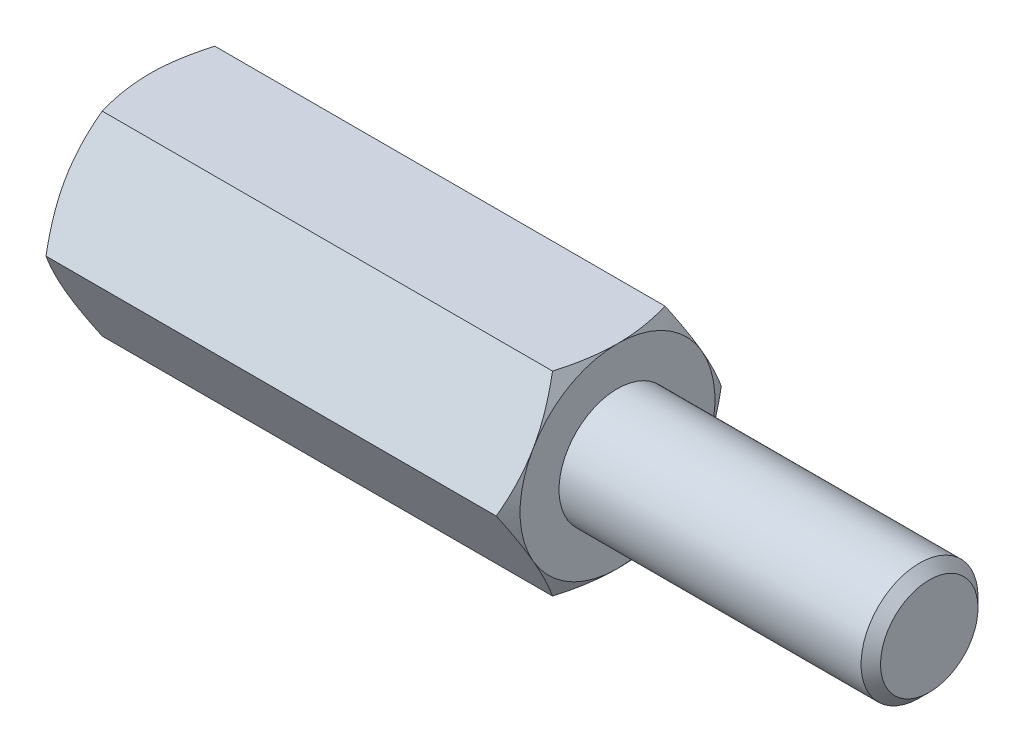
ISO-10303-21;
HEADER;
FILE_DESCRIPTION(('STEP AP214'),'2;1');
FILE_NAME('part.step','',(''),(''),'','','');
FILE_SCHEMA(('AUTOMOTIVE_DESIGN { 1 0 10303 214 1 1 1 1 }'));
ENDSEC;
DATA;
#1=APPLICATION_CONTEXT('core data for automotive mechanical design processes');
#2=APPLICATION_PROTOCOL_DEFINITION('international standard','automotive_design',2000,#1);
#3=PRODUCT_CONTEXT('',#1,'mechanical');
#4=PRODUCT('Part','Part','',(#3));
#5=PRODUCT_RELATED_PRODUCT_CATEGORY('part','',(#4));
#6=PRODUCT_DEFINITION_FORMATION('','',#4);
#7=PRODUCT_DEFINITION_CONTEXT('part definition',#1,'design');
#8=PRODUCT_DEFINITION('design','',#6,#7);
#9=PRODUCT_DEFINITION_SHAPE('','',#8);
#10=(LENGTH_UNIT() NAMED_UNIT(*) SI_UNIT(.MILLI.,.METRE.));
#11=(NAMED_UNIT(*) PLANE_ANGLE_UNIT() SI_UNIT($,.RADIAN.));
#12=(NAMED_UNIT(*) SI_UNIT($,.STERADIAN.) SOLID_ANGLE_UNIT());
#13=UNCERTAINTY_MEASURE_WITH_UNIT(LENGTH_MEASURE(1.E-05),#10,'distance_accuracy_value','');
#14=(GEOMETRIC_REPRESENTATION_CONTEXT(3) GLOBAL_UNCERTAINTY_ASSIGNED_CONTEXT((#13)) GLOBAL_UNIT_ASSIGNED_CONTEXT((#10,
#11,#12)) REPRESENTATION_CONTEXT('',''));
#15=CARTESIAN_POINT('',(0.,0.,0.));
#16=DIRECTION('',(0.,0.,1.));
#17=DIRECTION('',(1.,0.,0.));
#18=AXIS2_PLACEMENT_3D('',#15,#16,#17);
#19=CARTESIAN_POINT('',(6.,2.5,-1.44337567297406));
#20=DIRECTION('',(1.,0.,0.));
#21=DIRECTION('',(0.,0.,-1.));
#22=AXIS2_PLACEMENT_3D('',#19,#20,#21);
#23=PLANE('',#22);
#24=CARTESIAN_POINT('',(6.,0.,0.));
#25=DIRECTION('',(1.,0.,0.));
#26=DIRECTION('',(0.,0.,-1.));
#27=AXIS2_PLACEMENT_3D('',#24,#25,#26);
#28=CIRCLE('',#27,2.5);
#29=CARTESIAN_POINT('',(6.,-1.25,-2.1650635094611));
#30=VERTEX_POINT('',#29);
#31=CARTESIAN_POINT('',(6.,1.25,-2.1650635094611));
#32=VERTEX_POINT('',#31);
#33=EDGE_CURVE('E288',#30,#32,#28,.T.);
#34=ORIENTED_EDGE('',*,*,#33,.T.);
#35=CARTESIAN_POINT('',(6.,2.5,0.));
#36=VERTEX_POINT('',#35);
#37=EDGE_CURVE('E53',#32,#36,#28,.T.);
#38=ORIENTED_EDGE('',*,*,#37,.T.);
#39=CARTESIAN_POINT('',(6.,1.25,2.1650635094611));
#40=VERTEX_POINT('',#39);
#41=EDGE_CURVE('E295',#36,#40,#28,.T.);
#42=ORIENTED_EDGE('',*,*,#41,.T.);
#43=CARTESIAN_POINT('',(6.,-1.25,2.1650635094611));
#44=VERTEX_POINT('',#43);
#45=EDGE_CURVE('E300',#40,#44,#28,.T.);
#46=ORIENTED_EDGE('',*,*,#45,.T.);
#47=CARTESIAN_POINT('',(6.,0.,0.));
#48=DIRECTION('',(-1.,0.,0.));
#49=DIRECTION('',(0.,-1.,0.));
#50=AXIS2_PLACEMENT_3D('',#47,#48,#49);
#51=CIRCLE('',#50,2.5);
#52=CARTESIAN_POINT('',(6.,-2.5,0.));
#53=VERTEX_POINT('',#52);
#54=EDGE_CURVE('E193',#53,#44,#51,.T.);
#55=ORIENTED_EDGE('',*,*,#54,.F.);
#56=EDGE_CURVE('E61',#53,#30,#28,.T.);
#57=ORIENTED_EDGE('',*,*,#56,.T.);
#58=EDGE_LOOP('',(#34,#38,#42,#46,#55,#57));
#59=FACE_BOUND('',#58,.T.);
#60=CARTESIAN_POINT('',(6.,0.,0.));
#61=DIRECTION('',(1.,0.,0.));
#62=DIRECTION('',(0.,0.,-1.));
#63=AXIS2_PLACEMENT_3D('',#60,#61,#62);
#64=CIRCLE('',#63,1.5);
#65=CARTESIAN_POINT('',(6.,0.,-1.5));
#66=VERTEX_POINT('',#65);
#67=EDGE_CURVE('E318',#66,#66,#64,.T.);
#68=ORIENTED_EDGE('',*,*,#67,.F.);
#69=EDGE_LOOP('',(#68));
#70=FACE_BOUND('',#69,.T.);
#71=ADVANCED_FACE('F37',(#59,#70),#23,.T.);
#72=CARTESIAN_POINT('',(6.,0.,-2.88675134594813));
#73=DIRECTION('',(0.,-0.5,0.866025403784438));
#74=DIRECTION('',(0.,-0.866025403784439,-0.5));
#75=AXIS2_PLACEMENT_3D('',#72,#73,#74);
#76=PLANE('',#75);
#77=CARTESIAN_POINT('',(5.77664233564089,-0.000199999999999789,-2.88686681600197));
#78=CARTESIAN_POINT('',(5.81327837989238,0.109663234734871,-2.82343724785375));
#79=CARTESIAN_POINT('',(5.84659778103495,0.220474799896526,-2.75946016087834));
#80=CARTESIAN_POINT('',(5.90475771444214,0.444016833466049,-2.63039810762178));
#81=CARTESIAN_POINT('',(5.92957767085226,0.556751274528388,-2.5653108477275));
#82=CARTESIAN_POINT('',(5.96821434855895,0.780822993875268,-2.43594298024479));
#83=CARTESIAN_POINT('',(5.98228820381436,0.892125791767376,-2.37168227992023));
#84=CARTESIAN_POINT('',(5.99909084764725,1.11525522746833,-2.24285844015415));
#85=CARTESIAN_POINT('',(6.00183354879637,1.22708105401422,-2.17829576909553));
#86=CARTESIAN_POINT('',(5.99613423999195,1.43604197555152,-2.05765212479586));
#87=CARTESIAN_POINT('',(5.98909160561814,1.53320831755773,-2.0015531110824));
#88=CARTESIAN_POINT('',(5.96676858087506,1.726907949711,-1.88972057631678));
#89=CARTESIAN_POINT('',(5.95148056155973,1.82344056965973,-1.8339874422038));
#90=CARTESIAN_POINT('',(5.91326090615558,2.01753972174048,-1.7219242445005));
#91=CARTESIAN_POINT('',(5.89016722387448,2.11508168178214,-1.66560836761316));
#92=CARTESIAN_POINT('',(5.83775334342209,2.30871060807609,-1.55381665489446));
#93=CARTESIAN_POINT('',(5.80844546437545,2.40480005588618,-1.49833938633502));
#94=CARTESIAN_POINT('',(5.77664233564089,2.5002,-1.44326020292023));
#95=B_SPLINE_CURVE_WITH_KNOTS('',3,(#77,#78,#79,#80,#81,#82,#83,#84,#85,#86,#87,#88,#89,#90,#91,
#92,#93,#94),.UNSPECIFIED.,.F.,.F.,(4,2,2,2,2,2,2,2,4),(0.,0.396285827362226,0.793524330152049,
1.18093086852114,1.56786160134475,1.90479741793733,2.24204551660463,2.58677531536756,
2.93082800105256),.UNSPECIFIED.);
#96=CARTESIAN_POINT('',(5.7767090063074,0.,-2.88675134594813));
#97=VERTEX_POINT('',#96);
#98=EDGE_CURVE('E352',#97,#32,#95,.T.);
#99=ORIENTED_EDGE('',*,*,#98,.F.);
#100=DIRECTION('',(-1.,0.,0.));
#101=VECTOR('',#100,1.);
#102=CARTESIAN_POINT('',(6.,0.,-2.88675134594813));
#103=LINE('',#102,#101);
#104=CARTESIAN_POINT('',(-5.7767090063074,0.,-2.88675134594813));
#105=VERTEX_POINT('',#104);
#106=EDGE_CURVE('E264',#97,#105,#103,.T.);
#107=ORIENTED_EDGE('',*,*,#106,.T.);
#108=CARTESIAN_POINT('',(-5.77664233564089,2.5002,-1.44326020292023));
#109=CARTESIAN_POINT('',(-5.81327837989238,2.39033676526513,-1.50668977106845));
#110=CARTESIAN_POINT('',(-5.84659778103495,2.27952520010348,-1.57066685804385));
#111=CARTESIAN_POINT('',(-5.90475771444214,2.05598316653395,-1.69972891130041));
#112=CARTESIAN_POINT('',(-5.92957767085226,1.94324872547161,-1.7648161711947));
#113=CARTESIAN_POINT('',(-5.96821434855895,1.71917700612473,-1.8941840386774));
#114=CARTESIAN_POINT('',(-5.98228820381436,1.60787420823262,-1.95844473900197));
#115=CARTESIAN_POINT('',(-5.99909084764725,1.38474477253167,-2.08726857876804));
#116=CARTESIAN_POINT('',(-6.00183354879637,1.27291894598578,-2.15183124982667));
#117=CARTESIAN_POINT('',(-5.99613423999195,1.06395802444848,-2.27247489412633));
#118=CARTESIAN_POINT('',(-5.98909160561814,0.96679168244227,-2.32857390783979));
#119=CARTESIAN_POINT('',(-5.96676858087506,0.773092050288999,-2.44040644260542));
#120=CARTESIAN_POINT('',(-5.95148056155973,0.676559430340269,-2.49613957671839));
#121=CARTESIAN_POINT('',(-5.91326090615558,0.482460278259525,-2.60820277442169));
#122=CARTESIAN_POINT('',(-5.89016722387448,0.38491831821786,-2.66451865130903));
#123=CARTESIAN_POINT('',(-5.83775334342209,0.191289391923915,-2.77631036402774));
#124=CARTESIAN_POINT('',(-5.80844546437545,0.095199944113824,-2.83178763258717));
#125=CARTESIAN_POINT('',(-5.77664233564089,-0.000199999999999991,-2.88686681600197));
#126=B_SPLINE_CURVE_WITH_KNOTS('',3,(#108,#109,#110,#111,#112,#113,#114,#115,#116,#117,#118,
#119,#120,#121,#122,#123,#124,#125),.UNSPECIFIED.,.F.,.F.,(4,2,2,2,2,2,2,2,4),(0.,
0.396285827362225,0.793524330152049,1.18093086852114,1.56786160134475,1.90479741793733,
2.24204551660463,2.58677531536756,2.93082800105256),.UNSPECIFIED.);
#127=CARTESIAN_POINT('',(-6.,1.25,-2.1650635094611));
#128=VERTEX_POINT('',#127);
#129=EDGE_CURVE('E368',#128,#105,#126,.T.);
#130=ORIENTED_EDGE('',*,*,#129,.F.);
#131=CARTESIAN_POINT('',(-5.7767090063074,2.5,-1.44337567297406));
#132=VERTEX_POINT('',#131);
#133=EDGE_CURVE('E311',#132,#128,#126,.T.);
#134=ORIENTED_EDGE('',*,*,#133,.F.);
#135=DIRECTION('',(-1.,0.,0.));
#136=VECTOR('',#135,1.);
#137=CARTESIAN_POINT('',(6.,2.5,-1.44337567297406));
#138=LINE('',#137,#136);
#139=CARTESIAN_POINT('',(5.77670900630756,2.5,-1.44337567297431));
#140=VERTEX_POINT('',#139);
#141=EDGE_CURVE('E279',#140,#132,#138,.T.);
#142=ORIENTED_EDGE('',*,*,#141,.F.);
#143=EDGE_CURVE('E229',#32,#140,#95,.T.);
#144=ORIENTED_EDGE('',*,*,#143,.F.);
#145=EDGE_LOOP('',(#99,#107,#130,#134,#142,#144));
#146=FACE_BOUND('',#145,.T.);
#147=ADVANCED_FACE('F148',(#146),#76,.F.);
#148=CARTESIAN_POINT('',(6.,2.5,-1.44337567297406));
#149=DIRECTION('',(0.,-1.,0.));
#150=DIRECTION('',(0.,0.,-1.));
#151=AXIS2_PLACEMENT_3D('',#148,#149,#150);
#152=PLANE('',#151);
#153=CARTESIAN_POINT('',(4.76803388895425,2.5,-3.90158441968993));
#154=CARTESIAN_POINT('',(4.82120772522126,2.5,-3.79217004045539));
#155=CARTESIAN_POINT('',(4.87387869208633,2.5,-3.68250707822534));
#156=CARTESIAN_POINT('',(4.97793249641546,2.5,-3.46255185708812));
#157=CARTESIAN_POINT('',(5.02931513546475,2.5,-3.35225950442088));
#158=CARTESIAN_POINT('',(5.13076309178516,2.5,-3.130356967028));
#159=CARTESIAN_POINT('',(5.18081992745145,2.5,-3.01874289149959));
#160=CARTESIAN_POINT('',(5.27891712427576,2.5,-2.79463535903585));
#161=CARTESIAN_POINT('',(5.32695757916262,2.5,-2.68214194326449));
#162=CARTESIAN_POINT('',(5.42201845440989,2.5,-2.45240385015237));
#163=CARTESIAN_POINT('',(5.46895431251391,2.5,-2.33512399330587));
#164=CARTESIAN_POINT('',(5.55933269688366,2.5,-2.09920133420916));
#165=CARTESIAN_POINT('',(5.60277483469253,2.5,-1.98055838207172));
#166=CARTESIAN_POINT('',(5.68504351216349,2.5,-1.74193489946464));
#167=CARTESIAN_POINT('',(5.72387917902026,2.5,-1.6219575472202));
#168=CARTESIAN_POINT('',(5.79570507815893,2.5,-1.38028205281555));
#169=CARTESIAN_POINT('',(5.82869712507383,2.5,-1.25858445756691));
#170=CARTESIAN_POINT('',(5.88709594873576,2.5,-1.01406369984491));
#171=CARTESIAN_POINT('',(5.91254379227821,2.5,-0.891250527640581));
#172=CARTESIAN_POINT('',(5.95442751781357,2.5,-0.644071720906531));
#173=CARTESIAN_POINT('',(5.97086432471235,2.5,-0.519706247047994));
#174=CARTESIAN_POINT('',(5.9932006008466,2.5,-0.271679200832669));
#175=CARTESIAN_POINT('',(5.99923751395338,2.5,-0.148030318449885));
#176=CARTESIAN_POINT('',(6.00062561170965,2.5,0.0993395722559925));
#177=CARTESIAN_POINT('',(5.99597656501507,2.5,0.223060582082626));
#178=CARTESIAN_POINT('',(5.97940443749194,2.5,0.432351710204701));
#179=CARTESIAN_POINT('',(5.97010665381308,2.5,0.518143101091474));
#180=CARTESIAN_POINT('',(5.94693847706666,2.5,0.689112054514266));
#181=CARTESIAN_POINT('',(5.93306748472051,2.5,0.774289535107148));
#182=CARTESIAN_POINT('',(5.88532020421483,2.5,1.02876599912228));
#183=CARTESIAN_POINT('',(5.84531764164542,2.5,1.19691958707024));
#184=CARTESIAN_POINT('',(5.75226567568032,2.5,1.53362893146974));
#185=CARTESIAN_POINT('',(5.69893620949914,2.5,1.70210423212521));
#186=CARTESIAN_POINT('',(5.61237169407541,2.5,1.95247339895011));
#187=CARTESIAN_POINT('',(5.58242477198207,2.5,2.03553184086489));
#188=CARTESIAN_POINT('',(5.52068409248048,2.5,2.20095860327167));
#189=CARTESIAN_POINT('',(5.48889037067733,2.5,2.2833269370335));
#190=CARTESIAN_POINT('',(5.40401426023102,2.5,2.49723312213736));
#191=CARTESIAN_POINT('',(5.34971733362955,2.5,2.6282879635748));
#192=CARTESIAN_POINT('',(5.2381273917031,2.5,2.88912034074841));
#193=CARTESIAN_POINT('',(5.1808341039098,2.5,3.01889775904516));
#194=CARTESIAN_POINT('',(5.06393487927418,2.5,3.27745045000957));
#195=CARTESIAN_POINT('',(5.00432825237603,2.5,3.40622540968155));
#196=CARTESIAN_POINT('',(4.8833234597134,2.5,3.66293235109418));
#197=CARTESIAN_POINT('',(4.82192524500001,2.5,3.79086430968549));
#198=CARTESIAN_POINT('',(4.6354580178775,2.5,4.17399495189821));
#199=CARTESIAN_POINT('',(4.50828249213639,2.5,4.42816724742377));
#200=CARTESIAN_POINT('',(4.25034557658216,2.5,4.93461464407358));
#201=CARTESIAN_POINT('',(4.11958483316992,2.5,5.18689007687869));
#202=CARTESIAN_POINT('',(3.86871001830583,2.5,5.66512451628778));
#203=CARTESIAN_POINT('',(3.74882986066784,2.5,5.89120644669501));
#204=CARTESIAN_POINT('',(3.50759021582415,2.5,6.34259369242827));
#205=CARTESIAN_POINT('',(3.38623065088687,2.5,6.56789896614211));
#206=CARTESIAN_POINT('',(3.14278038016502,2.5,7.01722044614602));
#207=CARTESIAN_POINT('',(3.02069305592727,2.5,7.24123848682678));
#208=CARTESIAN_POINT('',(2.77566624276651,2.5,7.68878772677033));
#209=CARTESIAN_POINT('',(2.65272681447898,2.5,7.9123189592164));
#210=CARTESIAN_POINT('',(2.52947566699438,2.5,8.13567697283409));
#211=B_SPLINE_CURVE_WITH_KNOTS('',3,(#153,#154,#155,#156,#157,#158,#159,#160,#161,#162,#163,
#164,#165,#166,#167,#168,#169,#170,#171,#172,#173,#174,#175,#176,#177,#178,#179,#180,#181,#182,
#183,#184,#185,#186,#187,#188,#189,#190,#191,#192,#193,#194,#195,#196,#197,#198,#199,#200,#201,
#202,#203,#204,#205,#206,#207,#208,#209,#210),.UNSPECIFIED.,.F.,.F.,(4,2,2,2,2,2,2,2,2,2,2,2,2,
2,2,2,2,2,2,2,2,2,2,2,2,2,2,2,4),(0.,0.364957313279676,0.729970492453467,1.09692930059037,
1.46387103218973,1.84279746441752,2.22176597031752,2.59997058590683,2.97805755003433,
3.35404692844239,3.72999770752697,4.10094071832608,4.47189175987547,4.73064905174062,
4.98944026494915,5.5072907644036,6.03710483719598,6.30196454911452,6.56681915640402,
6.99233818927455,7.41789598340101,7.84358170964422,8.26927907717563,9.12186602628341,
9.97430025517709,10.7419897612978,11.5097197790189,12.2750964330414,13.0404191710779),.UNSPECIFIED.);
#212=EDGE_CURVE('E227',#140,#36,#211,.T.);
#213=ORIENTED_EDGE('',*,*,#212,.F.);
#214=ORIENTED_EDGE('',*,*,#141,.T.);
#215=CARTESIAN_POINT('',(-4.76803388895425,2.5,-3.90158441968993));
#216=CARTESIAN_POINT('',(-4.82120772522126,2.5,-3.79217004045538));
#217=CARTESIAN_POINT('',(-4.87387869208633,2.5,-3.68250707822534));
#218=CARTESIAN_POINT('',(-4.97793249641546,2.5,-3.46255185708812));
#219=CARTESIAN_POINT('',(-5.02931513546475,2.5,-3.35225950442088));
#220=CARTESIAN_POINT('',(-5.13076309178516,2.5,-3.130356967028));
#221=CARTESIAN_POINT('',(-5.18081992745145,2.5,-3.01874289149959));
#222=CARTESIAN_POINT('',(-5.27891712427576,2.5,-2.79463535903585));
#223=CARTESIAN_POINT('',(-5.32695757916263,2.5,-2.68214194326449));
#224=CARTESIAN_POINT('',(-5.42201845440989,2.5,-2.45240385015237));
#225=CARTESIAN_POINT('',(-5.46895431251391,2.5,-2.33512399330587));
#226=CARTESIAN_POINT('',(-5.55933269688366,2.5,-2.09920133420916));
#227=CARTESIAN_POINT('',(-5.60277483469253,2.5,-1.98055838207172));
#228=CARTESIAN_POINT('',(-5.68504351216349,2.5,-1.74193489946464));
#229=CARTESIAN_POINT('',(-5.72387917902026,2.5,-1.6219575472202));
#230=CARTESIAN_POINT('',(-5.79570507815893,2.5,-1.38028205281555));
#231=CARTESIAN_POINT('',(-5.82869712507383,2.5,-1.25858445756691));
#232=CARTESIAN_POINT('',(-5.88709594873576,2.5,-1.01406369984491));
#233=CARTESIAN_POINT('',(-5.91254379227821,2.5,-0.891250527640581));
#234=CARTESIAN_POINT('',(-5.95442751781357,2.5,-0.64407172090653));
#235=CARTESIAN_POINT('',(-5.97086432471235,2.5,-0.519706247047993));
#236=CARTESIAN_POINT('',(-5.9932006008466,2.5,-0.271679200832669));
#237=CARTESIAN_POINT('',(-5.99923751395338,2.5,-0.148030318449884));
#238=CARTESIAN_POINT('',(-6.00062561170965,2.5,0.0993395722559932));
#239=CARTESIAN_POINT('',(-5.99597656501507,2.5,0.223060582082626));
#240=CARTESIAN_POINT('',(-5.97940443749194,2.5,0.432351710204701));
#241=CARTESIAN_POINT('',(-5.97010665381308,2.5,0.518143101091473));
#242=CARTESIAN_POINT('',(-5.94693847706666,2.5,0.689112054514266));
#243=CARTESIAN_POINT('',(-5.93306748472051,2.5,0.774289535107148));
#244=CARTESIAN_POINT('',(-5.88532020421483,2.5,1.02876599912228));
#245=CARTESIAN_POINT('',(-5.84531764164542,2.5,1.19691958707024));
#246=CARTESIAN_POINT('',(-5.75226567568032,2.5,1.53362893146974));
#247=CARTESIAN_POINT('',(-5.69893620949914,2.5,1.70210423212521));
#248=CARTESIAN_POINT('',(-5.61237169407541,2.5,1.95247339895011));
#249=CARTESIAN_POINT('',(-5.58242477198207,2.5,2.03553184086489));
#250=CARTESIAN_POINT('',(-5.52068409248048,2.5,2.20095860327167));
#251=CARTESIAN_POINT('',(-5.48889037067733,2.5,2.2833269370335));
#252=CARTESIAN_POINT('',(-5.40401426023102,2.5,2.49723312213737));
#253=CARTESIAN_POINT('',(-5.34971733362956,2.5,2.6282879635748));
#254=CARTESIAN_POINT('',(-5.2381273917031,2.5,2.88912034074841));
#255=CARTESIAN_POINT('',(-5.1808341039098,2.5,3.01889775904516));
#256=CARTESIAN_POINT('',(-5.06393487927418,2.5,3.27745045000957));
#257=CARTESIAN_POINT('',(-5.00432825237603,2.5,3.40622540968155));
#258=CARTESIAN_POINT('',(-4.88332345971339,2.5,3.66293235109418));
#259=CARTESIAN_POINT('',(-4.82192524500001,2.5,3.79086430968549));
#260=CARTESIAN_POINT('',(-4.6354580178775,2.5,4.17399495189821));
#261=CARTESIAN_POINT('',(-4.50828249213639,2.5,4.42816724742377));
#262=CARTESIAN_POINT('',(-4.25034557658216,2.5,4.93461464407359));
#263=CARTESIAN_POINT('',(-4.11958483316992,2.5,5.18689007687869));
#264=CARTESIAN_POINT('',(-3.86871001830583,2.5,5.66512451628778));
#265=CARTESIAN_POINT('',(-3.74882986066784,2.5,5.89120644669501));
#266=CARTESIAN_POINT('',(-3.50759021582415,2.5,6.34259369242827));
#267=CARTESIAN_POINT('',(-3.38623065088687,2.5,6.56789896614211));
#268=CARTESIAN_POINT('',(-3.14278038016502,2.5,7.01722044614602));
#269=CARTESIAN_POINT('',(-3.02069305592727,2.5,7.24123848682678));
#270=CARTESIAN_POINT('',(-2.77566624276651,2.5,7.68878772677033));
#271=CARTESIAN_POINT('',(-2.65272681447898,2.5,7.9123189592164));
#272=CARTESIAN_POINT('',(-2.52947566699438,2.5,8.13567697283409));
#273=B_SPLINE_CURVE_WITH_KNOTS('',3,(#215,#216,#217,#218,#219,#220,#221,#222,#223,#224,#225,
#226,#227,#228,#229,#230,#231,#232,#233,#234,#235,#236,#237,#238,#239,#240,#241,#242,#243,#244,
#245,#246,#247,#248,#249,#250,#251,#252,#253,#254,#255,#256,#257,#258,#259,#260,#261,#262,#263,
#264,#265,#266,#267,#268,#269,#270,#271,#272),.UNSPECIFIED.,.F.,.F.,(4,2,2,2,2,2,2,2,2,2,2,2,2,
2,2,2,2,2,2,2,2,2,2,2,2,2,2,2,4),(0.,0.364957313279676,0.729970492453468,1.09692930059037,
1.46387103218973,1.84279746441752,2.22176597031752,2.59997058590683,2.97805755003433,
3.35404692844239,3.72999770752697,4.10094071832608,4.47189175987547,4.73064905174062,
4.98944026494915,5.5072907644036,6.03710483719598,6.30196454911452,6.56681915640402,
6.99233818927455,7.41789598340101,7.84358170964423,8.26927907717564,9.12186602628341,
9.9743002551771,10.7419897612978,11.5097197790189,12.2750964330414,13.0404191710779),.UNSPECIFIED.);
#274=CARTESIAN_POINT('',(-6.,2.5,0.));
#275=VERTEX_POINT('',#274);
#276=EDGE_CURVE('E241',#275,#132,#273,.F.);
#277=ORIENTED_EDGE('',*,*,#276,.F.);
#278=CARTESIAN_POINT('',(-5.7767090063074,2.5,1.44337567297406));
#279=VERTEX_POINT('',#278);
#280=EDGE_CURVE('E249',#279,#275,#273,.F.);
#281=ORIENTED_EDGE('',*,*,#280,.F.);
#282=DIRECTION('',(-1.,0.,0.));
#283=VECTOR('',#282,1.);
#284=CARTESIAN_POINT('',(6.,2.5,1.44337567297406));
#285=LINE('',#284,#283);
#286=CARTESIAN_POINT('',(5.7767090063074,2.5,1.44337567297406));
#287=VERTEX_POINT('',#286);
#288=EDGE_CURVE('E276',#287,#279,#285,.T.);
#289=ORIENTED_EDGE('',*,*,#288,.F.);
#290=EDGE_CURVE('E221',#36,#287,#211,.T.);
#291=ORIENTED_EDGE('',*,*,#290,.F.);
#292=EDGE_LOOP('',(#213,#214,#277,#281,#289,#291));
#293=FACE_BOUND('',#292,.T.);
#294=ADVANCED_FACE('F153',(#293),#152,.F.);
#295=CARTESIAN_POINT('',(6.,2.5,1.44337567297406));
#296=DIRECTION('',(0.,-0.5,-0.866025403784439));
#297=DIRECTION('',(0.,0.866025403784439,-0.5));
#298=AXIS2_PLACEMENT_3D('',#295,#296,#297);
#299=PLANE('',#298);
#300=CARTESIAN_POINT('',(5.77664233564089,2.5002,1.44326020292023));
#301=CARTESIAN_POINT('',(5.81327837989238,2.39033676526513,1.50668977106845));
#302=CARTESIAN_POINT('',(5.84659778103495,2.27952520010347,1.57066685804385));
#303=CARTESIAN_POINT('',(5.90475771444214,2.05598316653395,1.69972891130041));
#304=CARTESIAN_POINT('',(5.92957767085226,1.94324872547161,1.7648161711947));
#305=CARTESIAN_POINT('',(5.96821434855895,1.71917700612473,1.8941840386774));
#306=CARTESIAN_POINT('',(5.98228820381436,1.60787420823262,1.95844473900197));
#307=CARTESIAN_POINT('',(5.99909084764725,1.38474477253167,2.08726857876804));
#308=CARTESIAN_POINT('',(6.00183354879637,1.27291894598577,2.15183124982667));
#309=CARTESIAN_POINT('',(5.99613423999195,1.06395802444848,2.27247489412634));
#310=CARTESIAN_POINT('',(5.98909160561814,0.966791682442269,2.32857390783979));
#311=CARTESIAN_POINT('',(5.96676858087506,0.773092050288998,2.44040644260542));
#312=CARTESIAN_POINT('',(5.95148056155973,0.676559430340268,2.49613957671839));
#313=CARTESIAN_POINT('',(5.91326090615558,0.482460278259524,2.60820277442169));
#314=CARTESIAN_POINT('',(5.89016722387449,0.384918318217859,2.66451865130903));
#315=CARTESIAN_POINT('',(5.83775334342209,0.191289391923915,2.77631036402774));
#316=CARTESIAN_POINT('',(5.80844546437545,0.0951999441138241,2.83178763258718));
#317=CARTESIAN_POINT('',(5.77664233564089,-0.000199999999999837,2.88686681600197));
#318=B_SPLINE_CURVE_WITH_KNOTS('',3,(#300,#301,#302,#303,#304,#305,#306,#307,#308,#309,#310,
#311,#312,#313,#314,#315,#316,#317),.UNSPECIFIED.,.F.,.F.,(4,2,2,2,2,2,2,2,4),(0.,
0.396285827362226,0.79352433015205,1.18093086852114,1.56786160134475,1.90479741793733,
2.24204551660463,2.58677531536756,2.93082800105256),.UNSPECIFIED.);
#319=EDGE_CURVE('E228',#287,#40,#318,.T.);
#320=ORIENTED_EDGE('',*,*,#319,.F.);
#321=ORIENTED_EDGE('',*,*,#288,.T.);
#322=CARTESIAN_POINT('',(-5.77664233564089,-0.000199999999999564,2.88686681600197));
#323=CARTESIAN_POINT('',(-5.81327837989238,0.109663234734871,2.82343724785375));
#324=CARTESIAN_POINT('',(-5.84659778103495,0.220474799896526,2.75946016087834));
#325=CARTESIAN_POINT('',(-5.90475771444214,0.44401683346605,2.63039810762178));
#326=CARTESIAN_POINT('',(-5.92957767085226,0.556751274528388,2.5653108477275));
#327=CARTESIAN_POINT('',(-5.96821434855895,0.780822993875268,2.43594298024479));
#328=CARTESIAN_POINT('',(-5.98228820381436,0.892125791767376,2.37168227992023));
#329=CARTESIAN_POINT('',(-5.99909084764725,1.11525522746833,2.24285844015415));
#330=CARTESIAN_POINT('',(-6.00183354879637,1.22708105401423,2.17829576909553));
#331=CARTESIAN_POINT('',(-5.99613423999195,1.43604197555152,2.05765212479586));
#332=CARTESIAN_POINT('',(-5.98909160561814,1.53320831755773,2.0015531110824));
#333=CARTESIAN_POINT('',(-5.96676858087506,1.726907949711,1.88972057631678));
#334=CARTESIAN_POINT('',(-5.95148056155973,1.82344056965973,1.8339874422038));
#335=CARTESIAN_POINT('',(-5.91326090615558,2.01753972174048,1.7219242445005));
#336=CARTESIAN_POINT('',(-5.89016722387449,2.11508168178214,1.66560836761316));
#337=CARTESIAN_POINT('',(-5.83775334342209,2.30871060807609,1.55381665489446));
#338=CARTESIAN_POINT('',(-5.80844546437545,2.40480005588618,1.49833938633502));
#339=CARTESIAN_POINT('',(-5.77664233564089,2.5002,1.44326020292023));
#340=B_SPLINE_CURVE_WITH_KNOTS('',3,(#322,#323,#324,#325,#326,#327,#328,#329,#330,#331,#332,
#333,#334,#335,#336,#337,#338,#339),.UNSPECIFIED.,.F.,.F.,(4,2,2,2,2,2,2,2,4),(0.,
0.396285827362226,0.79352433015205,1.18093086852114,1.56786160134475,1.90479741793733,
2.24204551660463,2.58677531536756,2.93082800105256),.UNSPECIFIED.);
#341=CARTESIAN_POINT('',(-6.,1.25,2.1650635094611));
#342=VERTEX_POINT('',#341);
#343=EDGE_CURVE('E255',#342,#279,#340,.T.);
#344=ORIENTED_EDGE('',*,*,#343,.F.);
#345=CARTESIAN_POINT('',(-5.7767090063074,0.,2.88675134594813));
#346=VERTEX_POINT('',#345);
#347=EDGE_CURVE('E262',#346,#342,#340,.T.);
#348=ORIENTED_EDGE('',*,*,#347,.F.);
#349=DIRECTION('',(-1.,0.,0.));
#350=VECTOR('',#349,1.);
#351=CARTESIAN_POINT('',(6.,0.,2.88675134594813));
#352=LINE('',#351,#350);
#353=CARTESIAN_POINT('',(5.7767090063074,0.,2.88675134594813));
#354=VERTEX_POINT('',#353);
#355=EDGE_CURVE('E273',#354,#346,#352,.T.);
#356=ORIENTED_EDGE('',*,*,#355,.F.);
#357=EDGE_CURVE('E215',#40,#354,#318,.T.);
#358=ORIENTED_EDGE('',*,*,#357,.F.);
#359=EDGE_LOOP('',(#320,#321,#344,#348,#356,#358));
#360=FACE_BOUND('',#359,.T.);
#361=ADVANCED_FACE('F235',(#360),#299,.F.);
#362=CARTESIAN_POINT('',(6.,0.,2.88675134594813));
#363=DIRECTION('',(0.,0.5,-0.866025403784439));
#364=DIRECTION('',(0.,0.866025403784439,0.5));
#365=AXIS2_PLACEMENT_3D('',#362,#363,#364);
#366=PLANE('',#365);
#367=CARTESIAN_POINT('',(5.77664233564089,0.000200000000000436,2.88686681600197));
#368=CARTESIAN_POINT('',(5.81327837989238,-0.109663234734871,2.82343724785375));
#369=CARTESIAN_POINT('',(5.84659778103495,-0.220474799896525,2.75946016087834));
#370=CARTESIAN_POINT('',(5.90475771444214,-0.444016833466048,2.63039810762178));
#371=CARTESIAN_POINT('',(5.92957767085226,-0.556751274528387,2.5653108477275));
#372=CARTESIAN_POINT('',(5.96821434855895,-0.780822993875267,2.43594298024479));
#373=CARTESIAN_POINT('',(5.98228820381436,-0.892125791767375,2.37168227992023));
#374=CARTESIAN_POINT('',(5.99909084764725,-1.11525522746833,2.24285844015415));
#375=CARTESIAN_POINT('',(6.00183354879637,-1.22708105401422,2.17829576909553));
#376=CARTESIAN_POINT('',(5.99613423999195,-1.43604197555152,2.05765212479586));
#377=CARTESIAN_POINT('',(5.98909160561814,-1.53320831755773,2.0015531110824));
#378=CARTESIAN_POINT('',(5.96676858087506,-1.726907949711,1.88972057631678));
#379=CARTESIAN_POINT('',(5.95148056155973,-1.82344056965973,1.8339874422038));
#380=CARTESIAN_POINT('',(5.91326090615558,-2.01753972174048,1.7219242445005));
#381=CARTESIAN_POINT('',(5.89016722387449,-2.11508168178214,1.66560836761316));
#382=CARTESIAN_POINT('',(5.83775334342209,-2.30871060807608,1.55381665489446));
#383=CARTESIAN_POINT('',(5.80844546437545,-2.40480005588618,1.49833938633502));
#384=CARTESIAN_POINT('',(5.77664233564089,-2.5002,1.44326020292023));
#385=B_SPLINE_CURVE_WITH_KNOTS('',3,(#367,#368,#369,#370,#371,#372,#373,#374,#375,#376,#377,
#378,#379,#380,#381,#382,#383,#384),.UNSPECIFIED.,.F.,.F.,(4,2,2,2,2,2,2,2,4),(0.,
0.396285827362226,0.793524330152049,1.18093086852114,1.56786160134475,1.90479741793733,
2.24204551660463,2.58677531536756,2.93082800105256),.UNSPECIFIED.);
#386=EDGE_CURVE('E315',#354,#44,#385,.T.);
#387=ORIENTED_EDGE('',*,*,#386,.F.);
#388=ORIENTED_EDGE('',*,*,#355,.T.);
#389=CARTESIAN_POINT('',(-5.77664233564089,-2.5002,1.44326020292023));
#390=CARTESIAN_POINT('',(-5.81327837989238,-2.39033676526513,1.50668977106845));
#391=CARTESIAN_POINT('',(-5.84659778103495,-2.27952520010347,1.57066685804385));
#392=CARTESIAN_POINT('',(-5.90475771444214,-2.05598316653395,1.69972891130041));
#393=CARTESIAN_POINT('',(-5.92957767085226,-1.94324872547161,1.7648161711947));
#394=CARTESIAN_POINT('',(-5.96821434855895,-1.71917700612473,1.8941840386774));
#395=CARTESIAN_POINT('',(-5.98228820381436,-1.60787420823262,1.95844473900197));
#396=CARTESIAN_POINT('',(-5.99909084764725,-1.38474477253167,2.08726857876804));
#397=CARTESIAN_POINT('',(-6.00183354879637,-1.27291894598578,2.15183124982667));
#398=CARTESIAN_POINT('',(-5.99613423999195,-1.06395802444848,2.27247489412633));
#399=CARTESIAN_POINT('',(-5.98909160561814,-0.96679168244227,2.32857390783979));
#400=CARTESIAN_POINT('',(-5.96676858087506,-0.773092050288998,2.44040644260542));
#401=CARTESIAN_POINT('',(-5.95148056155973,-0.676559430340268,2.49613957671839));
#402=CARTESIAN_POINT('',(-5.91326090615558,-0.482460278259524,2.60820277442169));
#403=CARTESIAN_POINT('',(-5.89016722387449,-0.384918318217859,2.66451865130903));
#404=CARTESIAN_POINT('',(-5.83775334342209,-0.191289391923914,2.77631036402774));
#405=CARTESIAN_POINT('',(-5.80844546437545,-0.0951999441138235,2.83178763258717));
#406=CARTESIAN_POINT('',(-5.77664233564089,0.000200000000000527,2.88686681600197));
#407=B_SPLINE_CURVE_WITH_KNOTS('',3,(#389,#390,#391,#392,#393,#394,#395,#396,#397,#398,#399,
#400,#401,#402,#403,#404,#405,#406),.UNSPECIFIED.,.F.,.F.,(4,2,2,2,2,2,2,2,4),(0.,
0.396285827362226,0.793524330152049,1.18093086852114,1.56786160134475,1.90479741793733,
2.24204551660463,2.58677531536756,2.93082800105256),.UNSPECIFIED.);
#408=CARTESIAN_POINT('',(-6.,-1.25,2.1650635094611));
#409=VERTEX_POINT('',#408);
#410=EDGE_CURVE('E263',#409,#346,#407,.T.);
#411=ORIENTED_EDGE('',*,*,#410,.F.);
#412=CARTESIAN_POINT('',(-5.7767090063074,-2.5,1.44337567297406));
#413=VERTEX_POINT('',#412);
#414=EDGE_CURVE('E250',#413,#409,#407,.T.);
#415=ORIENTED_EDGE('',*,*,#414,.F.);
#416=DIRECTION('',(-1.,0.,0.));
#417=VECTOR('',#416,1.);
#418=CARTESIAN_POINT('',(6.,-2.5,1.44337567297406));
#419=LINE('',#418,#417);
#420=CARTESIAN_POINT('',(5.7767090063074,-2.5,1.44337567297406));
#421=VERTEX_POINT('',#420);
#422=EDGE_CURVE('E270',#421,#413,#419,.T.);
#423=ORIENTED_EDGE('',*,*,#422,.F.);
#424=EDGE_CURVE('E210',#44,#421,#385,.T.);
#425=ORIENTED_EDGE('',*,*,#424,.F.);
#426=EDGE_LOOP('',(#387,#388,#411,#415,#423,#425));
#427=FACE_BOUND('',#426,.T.);
#428=ADVANCED_FACE('F402',(#427),#366,.F.);
#429=CARTESIAN_POINT('',(6.,-2.5,1.44337567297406));
#430=DIRECTION('',(0.,1.,0.));
#431=DIRECTION('',(0.,0.,1.));
#432=AXIS2_PLACEMENT_3D('',#429,#430,#431);
#433=PLANE('',#432);
#434=CARTESIAN_POINT('',(4.76803388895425,-2.5,-3.90158441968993));
#435=CARTESIAN_POINT('',(4.82120772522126,-2.5,-3.79217004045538));
#436=CARTESIAN_POINT('',(4.87387869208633,-2.5,-3.68250707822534));
#437=CARTESIAN_POINT('',(4.97793249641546,-2.5,-3.46255185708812));
#438=CARTESIAN_POINT('',(5.02931513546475,-2.5,-3.35225950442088));
#439=CARTESIAN_POINT('',(5.13076309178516,-2.5,-3.130356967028));
#440=CARTESIAN_POINT('',(5.18081992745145,-2.5,-3.01874289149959));
#441=CARTESIAN_POINT('',(5.27891712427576,-2.5,-2.79463535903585));
#442=CARTESIAN_POINT('',(5.32695757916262,-2.5,-2.68214194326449));
#443=CARTESIAN_POINT('',(5.42201845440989,-2.5,-2.45240385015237));
#444=CARTESIAN_POINT('',(5.46895431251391,-2.5,-2.33512399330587));
#445=CARTESIAN_POINT('',(5.55933269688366,-2.5,-2.09920133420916));
#446=CARTESIAN_POINT('',(5.60277483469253,-2.5,-1.98055838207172));
#447=CARTESIAN_POINT('',(5.68504351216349,-2.5,-1.74193489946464));
#448=CARTESIAN_POINT('',(5.72387917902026,-2.5,-1.6219575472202));
#449=CARTESIAN_POINT('',(5.79570507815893,-2.5,-1.38028205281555));
#450=CARTESIAN_POINT('',(5.82869712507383,-2.5,-1.25858445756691));
#451=CARTESIAN_POINT('',(5.88709594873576,-2.5,-1.01406369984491));
#452=CARTESIAN_POINT('',(5.91254379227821,-2.5,-0.891250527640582));
#453=CARTESIAN_POINT('',(5.95442751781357,-2.5,-0.644071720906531));
#454=CARTESIAN_POINT('',(5.97086432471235,-2.5,-0.519706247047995));
#455=CARTESIAN_POINT('',(5.9932006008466,-2.5,-0.27167920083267));
#456=CARTESIAN_POINT('',(5.99923751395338,-2.5,-0.148030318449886));
#457=CARTESIAN_POINT('',(6.00062561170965,-2.5,0.0993395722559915));
#458=CARTESIAN_POINT('',(5.99597656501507,-2.5,0.223060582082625));
#459=CARTESIAN_POINT('',(5.97940443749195,-2.5,0.432351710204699));
#460=CARTESIAN_POINT('',(5.97010665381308,-2.5,0.518143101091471));
#461=CARTESIAN_POINT('',(5.94693847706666,-2.5,0.689112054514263));
#462=CARTESIAN_POINT('',(5.93306748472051,-2.5,0.774289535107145));
#463=CARTESIAN_POINT('',(5.88532020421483,-2.5,1.02876599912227));
#464=CARTESIAN_POINT('',(5.84531764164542,-2.5,1.19691958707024));
#465=CARTESIAN_POINT('',(5.75226567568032,-2.5,1.53362893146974));
#466=CARTESIAN_POINT('',(5.69893620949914,-2.5,1.70210423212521));
#467=CARTESIAN_POINT('',(5.61237169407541,-2.5,1.95247339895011));
#468=CARTESIAN_POINT('',(5.58242477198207,-2.5,2.03553184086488));
#469=CARTESIAN_POINT('',(5.52068409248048,-2.5,2.20095860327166));
#470=CARTESIAN_POINT('',(5.48889037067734,-2.5,2.28332693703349));
#471=CARTESIAN_POINT('',(5.40401426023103,-2.5,2.49723312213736));
#472=CARTESIAN_POINT('',(5.34971733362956,-2.5,2.6282879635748));
#473=CARTESIAN_POINT('',(5.2381273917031,-2.5,2.8891203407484));
#474=CARTESIAN_POINT('',(5.1808341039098,-2.5,3.01889775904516));
#475=CARTESIAN_POINT('',(5.06393487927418,-2.5,3.27745045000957));
#476=CARTESIAN_POINT('',(5.00432825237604,-2.5,3.40622540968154));
#477=CARTESIAN_POINT('',(4.8833234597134,-2.5,3.66293235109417));
#478=CARTESIAN_POINT('',(4.82192524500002,-2.5,3.79086430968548));
#479=CARTESIAN_POINT('',(4.6354580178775,-2.5,4.1739949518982));
#480=CARTESIAN_POINT('',(4.50828249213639,-2.5,4.42816724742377));
#481=CARTESIAN_POINT('',(4.25034557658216,-2.5,4.93461464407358));
#482=CARTESIAN_POINT('',(4.11958483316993,-2.5,5.18689007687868));
#483=CARTESIAN_POINT('',(3.86871001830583,-2.5,5.66512451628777));
#484=CARTESIAN_POINT('',(3.74882986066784,-2.5,5.891206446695));
#485=CARTESIAN_POINT('',(3.50759021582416,-2.5,6.34259369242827));
#486=CARTESIAN_POINT('',(3.38623065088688,-2.5,6.5678989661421));
#487=CARTESIAN_POINT('',(3.14278038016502,-2.5,7.01722044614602));
#488=CARTESIAN_POINT('',(3.02069305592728,-2.5,7.24123848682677));
#489=CARTESIAN_POINT('',(2.77566624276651,-2.5,7.68878772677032));
#490=CARTESIAN_POINT('',(2.65272681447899,-2.5,7.9123189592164));
#491=CARTESIAN_POINT('',(2.52947566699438,-2.5,8.13567697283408));
#492=B_SPLINE_CURVE_WITH_KNOTS('',3,(#434,#435,#436,#437,#438,#439,#440,#441,#442,#443,#444,
#445,#446,#447,#448,#449,#450,#451,#452,#453,#454,#455,#456,#457,#458,#459,#460,#461,#462,#463,
#464,#465,#466,#467,#468,#469,#470,#471,#472,#473,#474,#475,#476,#477,#478,#479,#480,#481,#482,
#483,#484,#485,#486,#487,#488,#489,#490,#491),.UNSPECIFIED.,.F.,.F.,(4,2,2,2,2,2,2,2,2,2,2,2,2,
2,2,2,2,2,2,2,2,2,2,2,2,2,2,2,4),(0.,0.364957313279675,0.729970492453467,1.09692930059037,
1.46387103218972,1.84279746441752,2.22176597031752,2.59997058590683,2.97805755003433,
3.35404692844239,3.72999770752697,4.10094071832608,4.47189175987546,4.73064905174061,
4.98944026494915,5.50729076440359,6.03710483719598,6.30196454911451,6.56681915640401,
6.99233818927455,7.417895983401,7.84358170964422,8.26927907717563,9.12186602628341,
9.97430025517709,10.7419897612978,11.5097197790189,12.2750964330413,13.0404191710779),.UNSPECIFIED.);
#493=EDGE_CURVE('E312',#421,#53,#492,.F.);
#494=ORIENTED_EDGE('',*,*,#493,.F.);
#495=ORIENTED_EDGE('',*,*,#422,.T.);
#496=CARTESIAN_POINT('',(-4.76803388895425,-2.5,-3.90158441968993));
#497=CARTESIAN_POINT('',(-4.82120772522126,-2.5,-3.79217004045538));
#498=CARTESIAN_POINT('',(-4.87387869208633,-2.5,-3.68250707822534));
#499=CARTESIAN_POINT('',(-4.97793249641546,-2.5,-3.46255185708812));
#500=CARTESIAN_POINT('',(-5.02931513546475,-2.5,-3.35225950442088));
#501=CARTESIAN_POINT('',(-5.13076309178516,-2.5,-3.130356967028));
#502=CARTESIAN_POINT('',(-5.18081992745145,-2.5,-3.01874289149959));
#503=CARTESIAN_POINT('',(-5.27891712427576,-2.5,-2.79463535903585));
#504=CARTESIAN_POINT('',(-5.32695757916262,-2.5,-2.68214194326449));
#505=CARTESIAN_POINT('',(-5.42201845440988,-2.5,-2.45240385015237));
#506=CARTESIAN_POINT('',(-5.46895431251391,-2.5,-2.33512399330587));
#507=CARTESIAN_POINT('',(-5.55933269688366,-2.5,-2.09920133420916));
#508=CARTESIAN_POINT('',(-5.60277483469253,-2.5,-1.98055838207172));
#509=CARTESIAN_POINT('',(-5.68504351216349,-2.5,-1.74193489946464));
#510=CARTESIAN_POINT('',(-5.72387917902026,-2.5,-1.6219575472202));
#511=CARTESIAN_POINT('',(-5.79570507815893,-2.5,-1.38028205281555));
#512=CARTESIAN_POINT('',(-5.82869712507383,-2.5,-1.25858445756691));
#513=CARTESIAN_POINT('',(-5.88709594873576,-2.5,-1.01406369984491));
#514=CARTESIAN_POINT('',(-5.91254379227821,-2.5,-0.891250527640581));
#515=CARTESIAN_POINT('',(-5.95442751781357,-2.5,-0.644071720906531));
#516=CARTESIAN_POINT('',(-5.97086432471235,-2.5,-0.519706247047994));
#517=CARTESIAN_POINT('',(-5.9932006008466,-2.5,-0.271679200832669));
#518=CARTESIAN_POINT('',(-5.99923751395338,-2.5,-0.148030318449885));
#519=CARTESIAN_POINT('',(-6.00062561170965,-2.5,0.0993395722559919));
#520=CARTESIAN_POINT('',(-5.99597656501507,-2.5,0.223060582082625));
#521=CARTESIAN_POINT('',(-5.97940443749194,-2.5,0.4323517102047));
#522=CARTESIAN_POINT('',(-5.97010665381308,-2.5,0.518143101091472));
#523=CARTESIAN_POINT('',(-5.94693847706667,-2.5,0.689112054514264));
#524=CARTESIAN_POINT('',(-5.93306748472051,-2.5,0.774289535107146));
#525=CARTESIAN_POINT('',(-5.88532020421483,-2.5,1.02876599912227));
#526=CARTESIAN_POINT('',(-5.84531764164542,-2.5,1.19691958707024));
#527=CARTESIAN_POINT('',(-5.75226567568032,-2.5,1.53362893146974));
#528=CARTESIAN_POINT('',(-5.69893620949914,-2.5,1.70210423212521));
#529=CARTESIAN_POINT('',(-5.61237169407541,-2.5,1.95247339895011));
#530=CARTESIAN_POINT('',(-5.58242477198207,-2.5,2.03553184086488));
#531=CARTESIAN_POINT('',(-5.52068409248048,-2.5,2.20095860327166));
#532=CARTESIAN_POINT('',(-5.48889037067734,-2.5,2.28332693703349));
#533=CARTESIAN_POINT('',(-5.40401426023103,-2.5,2.49723312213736));
#534=CARTESIAN_POINT('',(-5.34971733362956,-2.5,2.62828796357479));
#535=CARTESIAN_POINT('',(-5.2381273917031,-2.5,2.8891203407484));
#536=CARTESIAN_POINT('',(-5.1808341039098,-2.5,3.01889775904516));
#537=CARTESIAN_POINT('',(-5.06393487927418,-2.5,3.27745045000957));
#538=CARTESIAN_POINT('',(-5.00432825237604,-2.5,3.40622540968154));
#539=CARTESIAN_POINT('',(-4.8833234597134,-2.5,3.66293235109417));
#540=CARTESIAN_POINT('',(-4.82192524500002,-2.5,3.79086430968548));
#541=CARTESIAN_POINT('',(-4.6354580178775,-2.5,4.1739949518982));
#542=CARTESIAN_POINT('',(-4.50828249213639,-2.5,4.42816724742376));
#543=CARTESIAN_POINT('',(-4.25034557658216,-2.5,4.93461464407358));
#544=CARTESIAN_POINT('',(-4.11958483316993,-2.5,5.18689007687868));
#545=CARTESIAN_POINT('',(-3.86871001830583,-2.5,5.66512451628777));
#546=CARTESIAN_POINT('',(-3.74882986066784,-2.5,5.891206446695));
#547=CARTESIAN_POINT('',(-3.50759021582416,-2.5,6.34259369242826));
#548=CARTESIAN_POINT('',(-3.38623065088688,-2.5,6.5678989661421));
#549=CARTESIAN_POINT('',(-3.14278038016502,-2.5,7.01722044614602));
#550=CARTESIAN_POINT('',(-3.02069305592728,-2.5,7.24123848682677));
#551=CARTESIAN_POINT('',(-2.77566624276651,-2.5,7.68878772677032));
#552=CARTESIAN_POINT('',(-2.65272681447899,-2.5,7.9123189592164));
#553=CARTESIAN_POINT('',(-2.52947566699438,-2.5,8.13567697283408));
#554=B_SPLINE_CURVE_WITH_KNOTS('',3,(#496,#497,#498,#499,#500,#501,#502,#503,#504,#505,#506,
#507,#508,#509,#510,#511,#512,#513,#514,#515,#516,#517,#518,#519,#520,#521,#522,#523,#524,#525,
#526,#527,#528,#529,#530,#531,#532,#533,#534,#535,#536,#537,#538,#539,#540,#541,#542,#543,#544,
#545,#546,#547,#548,#549,#550,#551,#552,#553),.UNSPECIFIED.,.F.,.F.,(4,2,2,2,2,2,2,2,2,2,2,2,2,
2,2,2,2,2,2,2,2,2,2,2,2,2,2,2,4),(0.,0.364957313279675,0.729970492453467,1.09692930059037,
1.46387103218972,1.84279746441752,2.22176597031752,2.59997058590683,2.97805755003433,
3.35404692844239,3.72999770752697,4.10094071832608,4.47189175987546,4.73064905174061,
4.98944026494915,5.50729076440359,6.03710483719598,6.30196454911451,6.56681915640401,
6.99233818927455,7.417895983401,7.84358170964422,8.26927907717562,9.1218660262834,
9.97430025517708,10.7419897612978,11.5097197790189,12.2750964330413,13.0404191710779),.UNSPECIFIED.);
#555=CARTESIAN_POINT('',(-6.,-2.5,0.));
#556=VERTEX_POINT('',#555);
#557=EDGE_CURVE('E371',#556,#413,#554,.T.);
#558=ORIENTED_EDGE('',*,*,#557,.F.);
#559=CARTESIAN_POINT('',(-5.7767090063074,-2.5,-1.44337567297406));
#560=VERTEX_POINT('',#559);
#561=EDGE_CURVE('E374',#560,#556,#554,.T.);
#562=ORIENTED_EDGE('',*,*,#561,.F.);
#563=DIRECTION('',(-1.,0.,0.));
#564=VECTOR('',#563,1.);
#565=CARTESIAN_POINT('',(6.,-2.5,-1.44337567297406));
#566=LINE('',#565,#564);
#567=CARTESIAN_POINT('',(5.7767090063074,-2.5,-1.44337567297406));
#568=VERTEX_POINT('',#567);
#569=EDGE_CURVE('E267',#568,#560,#566,.T.);
#570=ORIENTED_EDGE('',*,*,#569,.F.);
#571=EDGE_CURVE('E195',#53,#568,#492,.F.);
#572=ORIENTED_EDGE('',*,*,#571,.F.);
#573=EDGE_LOOP('',(#494,#495,#558,#562,#570,#572));
#574=FACE_BOUND('',#573,.T.);
#575=ADVANCED_FACE('F172',(#574),#433,.F.);
#576=CARTESIAN_POINT('',(6.,-2.5,-1.44337567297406));
#577=DIRECTION('',(0.,0.5,0.866025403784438));
#578=DIRECTION('',(0.,-0.866025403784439,0.5));
#579=AXIS2_PLACEMENT_3D('',#576,#577,#578);
#580=PLANE('',#579);
#581=CARTESIAN_POINT('',(5.77664233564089,-2.5002,-1.44326020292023));
#582=CARTESIAN_POINT('',(5.81327837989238,-2.39033676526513,-1.50668977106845));
#583=CARTESIAN_POINT('',(5.84659778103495,-2.27952520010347,-1.57066685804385));
#584=CARTESIAN_POINT('',(5.90475771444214,-2.05598316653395,-1.69972891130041));
#585=CARTESIAN_POINT('',(5.92957767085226,-1.94324872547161,-1.7648161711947));
#586=CARTESIAN_POINT('',(5.96821434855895,-1.71917700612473,-1.8941840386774));
#587=CARTESIAN_POINT('',(5.98228820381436,-1.60787420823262,-1.95844473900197));
#588=CARTESIAN_POINT('',(5.99909084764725,-1.38474477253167,-2.08726857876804));
#589=CARTESIAN_POINT('',(6.00183354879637,-1.27291894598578,-2.15183124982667));
#590=CARTESIAN_POINT('',(5.99613423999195,-1.06395802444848,-2.27247489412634));
#591=CARTESIAN_POINT('',(5.98909160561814,-0.96679168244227,-2.32857390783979));
#592=CARTESIAN_POINT('',(5.96676858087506,-0.773092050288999,-2.44040644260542));
#593=CARTESIAN_POINT('',(5.95148056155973,-0.676559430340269,-2.49613957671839));
#594=CARTESIAN_POINT('',(5.91326090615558,-0.482460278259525,-2.60820277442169));
#595=CARTESIAN_POINT('',(5.89016722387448,-0.38491831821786,-2.66451865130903));
#596=CARTESIAN_POINT('',(5.83775334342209,-0.191289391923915,-2.77631036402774));
#597=CARTESIAN_POINT('',(5.80844546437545,-0.0951999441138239,-2.83178763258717));
#598=CARTESIAN_POINT('',(5.77664233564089,0.000200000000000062,-2.88686681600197));
#599=B_SPLINE_CURVE_WITH_KNOTS('',3,(#581,#582,#583,#584,#585,#586,#587,#588,#589,#590,#591,
#592,#593,#594,#595,#596,#597,#598),.UNSPECIFIED.,.F.,.F.,(4,2,2,2,2,2,2,2,4),(0.,
0.396285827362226,0.79352433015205,1.18093086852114,1.56786160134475,1.90479741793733,
2.24204551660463,2.58677531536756,2.93082800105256),.UNSPECIFIED.);
#600=EDGE_CURVE('E192',#568,#30,#599,.T.);
#601=ORIENTED_EDGE('',*,*,#600,.F.);
#602=ORIENTED_EDGE('',*,*,#569,.T.);
#603=CARTESIAN_POINT('',(-5.77664233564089,0.000200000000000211,-2.88686681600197));
#604=CARTESIAN_POINT('',(-5.81327837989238,-0.109663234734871,-2.82343724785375));
#605=CARTESIAN_POINT('',(-5.84659778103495,-0.220474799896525,-2.75946016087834));
#606=CARTESIAN_POINT('',(-5.90475771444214,-0.444016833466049,-2.63039810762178));
#607=CARTESIAN_POINT('',(-5.92957767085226,-0.556751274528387,-2.5653108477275));
#608=CARTESIAN_POINT('',(-5.96821434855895,-0.780822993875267,-2.43594298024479));
#609=CARTESIAN_POINT('',(-5.98228820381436,-0.892125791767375,-2.37168227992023));
#610=CARTESIAN_POINT('',(-5.99909084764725,-1.11525522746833,-2.24285844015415));
#611=CARTESIAN_POINT('',(-6.00183354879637,-1.22708105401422,-2.17829576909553));
#612=CARTESIAN_POINT('',(-5.99613423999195,-1.43604197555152,-2.05765212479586));
#613=CARTESIAN_POINT('',(-5.98909160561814,-1.53320831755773,-2.0015531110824));
#614=CARTESIAN_POINT('',(-5.96676858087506,-1.726907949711,-1.88972057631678));
#615=CARTESIAN_POINT('',(-5.95148056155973,-1.82344056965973,-1.8339874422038));
#616=CARTESIAN_POINT('',(-5.91326090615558,-2.01753972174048,-1.7219242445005));
#617=CARTESIAN_POINT('',(-5.89016722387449,-2.11508168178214,-1.66560836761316));
#618=CARTESIAN_POINT('',(-5.83775334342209,-2.30871060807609,-1.55381665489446));
#619=CARTESIAN_POINT('',(-5.80844546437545,-2.40480005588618,-1.49833938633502));
#620=CARTESIAN_POINT('',(-5.77664233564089,-2.5002,-1.44326020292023));
#621=B_SPLINE_CURVE_WITH_KNOTS('',3,(#603,#604,#605,#606,#607,#608,#609,#610,#611,#612,#613,
#614,#615,#616,#617,#618,#619,#620),.UNSPECIFIED.,.F.,.F.,(4,2,2,2,2,2,2,2,4),(0.,
0.396285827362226,0.793524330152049,1.18093086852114,1.56786160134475,1.90479741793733,
2.24204551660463,2.58677531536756,2.93082800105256),.UNSPECIFIED.);
#622=CARTESIAN_POINT('',(-6.,-1.25,-2.1650635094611));
#623=VERTEX_POINT('',#622);
#624=EDGE_CURVE('E178',#623,#560,#621,.T.);
#625=ORIENTED_EDGE('',*,*,#624,.F.);
#626=EDGE_CURVE('E383',#105,#623,#621,.T.);
#627=ORIENTED_EDGE('',*,*,#626,.F.);
#628=ORIENTED_EDGE('',*,*,#106,.F.);
#629=EDGE_CURVE('E185',#30,#97,#599,.T.);
#630=ORIENTED_EDGE('',*,*,#629,.F.);
#631=EDGE_LOOP('',(#601,#602,#625,#627,#628,#630));
#632=FACE_BOUND('',#631,.T.);
#633=ADVANCED_FACE('F167',(#632),#580,.F.);
#634=CARTESIAN_POINT('',(-6.,0.,0.));
#635=DIRECTION('',(1.,0.,0.));
#636=DIRECTION('',(0.,1.,0.));
#637=AXIS2_PLACEMENT_3D('',#634,#635,#636);
#638=CONICAL_SURFACE('',#637,2.5,1.0471975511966);
#639=ORIENTED_EDGE('',*,*,#129,.T.);
#640=ORIENTED_EDGE('',*,*,#626,.T.);
#641=CARTESIAN_POINT('',(-6.,0.,0.));
#642=DIRECTION('',(1.,0.,0.));
#643=DIRECTION('',(0.,0.,-1.));
#644=AXIS2_PLACEMENT_3D('',#641,#642,#643);
#645=CIRCLE('',#644,2.5);
#646=EDGE_CURVE('E282',#623,#128,#645,.T.);
#647=ORIENTED_EDGE('',*,*,#646,.T.);
#648=EDGE_LOOP('',(#639,#640,#647));
#649=FACE_BOUND('',#648,.T.);
#650=ADVANCED_FACE('F171',(#649),#638,.T.);
#651=ORIENTED_EDGE('',*,*,#561,.T.);
#652=EDGE_CURVE('E286',#556,#623,#645,.T.);
#653=ORIENTED_EDGE('',*,*,#652,.T.);
#654=ORIENTED_EDGE('',*,*,#624,.T.);
#655=EDGE_LOOP('',(#651,#653,#654));
#656=FACE_BOUND('',#655,.T.);
#657=ADVANCED_FACE('F392',(#656),#638,.T.);
#658=ORIENTED_EDGE('',*,*,#414,.T.);
#659=CARTESIAN_POINT('',(-6.,0.,0.));
#660=DIRECTION('',(-1.,0.,0.));
#661=DIRECTION('',(0.,-1.,0.));
#662=AXIS2_PLACEMENT_3D('',#659,#660,#661);
#663=CIRCLE('',#662,2.5);
#664=EDGE_CURVE('E358',#556,#409,#663,.T.);
#665=ORIENTED_EDGE('',*,*,#664,.F.);
#666=ORIENTED_EDGE('',*,*,#557,.T.);
#667=EDGE_LOOP('',(#658,#665,#666));
#668=FACE_BOUND('',#667,.T.);
#669=ADVANCED_FACE('F397',(#668),#638,.T.);
#670=ORIENTED_EDGE('',*,*,#347,.T.);
#671=EDGE_CURVE('E417',#342,#409,#645,.T.);
#672=ORIENTED_EDGE('',*,*,#671,.T.);
#673=ORIENTED_EDGE('',*,*,#410,.T.);
#674=EDGE_LOOP('',(#670,#672,#673));
#675=FACE_BOUND('',#674,.T.);
#676=ADVANCED_FACE('F158',(#675),#638,.T.);
#677=ORIENTED_EDGE('',*,*,#343,.T.);
#678=ORIENTED_EDGE('',*,*,#280,.T.);
#679=EDGE_CURVE('E412',#275,#342,#645,.T.);
#680=ORIENTED_EDGE('',*,*,#679,.T.);
#681=EDGE_LOOP('',(#677,#678,#680));
#682=FACE_BOUND('',#681,.T.);
#683=ADVANCED_FACE('F410',(#682),#638,.T.);
#684=ORIENTED_EDGE('',*,*,#276,.T.);
#685=ORIENTED_EDGE('',*,*,#133,.T.);
#686=EDGE_CURVE('E287',#128,#275,#645,.T.);
#687=ORIENTED_EDGE('',*,*,#686,.T.);
#688=EDGE_LOOP('',(#684,#685,#687));
#689=FACE_BOUND('',#688,.T.);
#690=ADVANCED_FACE('F165',(#689),#638,.T.);
#691=CARTESIAN_POINT('',(-6.,2.5,-1.44337567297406));
#692=DIRECTION('',(1.,0.,0.));
#693=DIRECTION('',(0.,0.,-1.));
#694=AXIS2_PLACEMENT_3D('',#691,#692,#693);
#695=PLANE('',#694);
#696=CARTESIAN_POINT('',(-6.,0.,0.));
#697=DIRECTION('',(-1.,0.,0.));
#698=DIRECTION('',(0.,0.,1.));
#699=AXIS2_PLACEMENT_3D('',#696,#697,#698);
#700=CIRCLE('',#699,1.25);
#701=CARTESIAN_POINT('',(-6.,0.,1.25));
#702=VERTEX_POINT('',#701);
#703=EDGE_CURVE('E326',#702,#702,#700,.T.);
#704=ORIENTED_EDGE('',*,*,#703,.F.);
#705=EDGE_LOOP('',(#704));
#706=FACE_BOUND('',#705,.T.);
#707=ORIENTED_EDGE('',*,*,#686,.F.);
#708=ORIENTED_EDGE('',*,*,#646,.F.);
#709=ORIENTED_EDGE('',*,*,#652,.F.);
#710=ORIENTED_EDGE('',*,*,#664,.T.);
#711=ORIENTED_EDGE('',*,*,#671,.F.);
#712=ORIENTED_EDGE('',*,*,#679,.F.);
#713=EDGE_LOOP('',(#707,#708,#709,#710,#711,#712));
#714=FACE_BOUND('',#713,.T.);
#715=ADVANCED_FACE('F161',(#706,#714),#695,.F.);
#716=CARTESIAN_POINT('',(6.,0.,0.));
#717=DIRECTION('',(-1.,0.,0.));
#718=DIRECTION('',(0.,1.,0.));
#719=AXIS2_PLACEMENT_3D('',#716,#717,#718);
#720=CONICAL_SURFACE('',#719,2.5,1.0471975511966);
#721=ORIENTED_EDGE('',*,*,#98,.T.);
#722=ORIENTED_EDGE('',*,*,#33,.F.);
#723=ORIENTED_EDGE('',*,*,#629,.T.);
#724=EDGE_LOOP('',(#721,#722,#723));
#725=FACE_BOUND('',#724,.T.);
#726=ADVANCED_FACE('F164',(#725),#720,.T.);
#727=ORIENTED_EDGE('',*,*,#571,.T.);
#728=ORIENTED_EDGE('',*,*,#600,.T.);
#729=ORIENTED_EDGE('',*,*,#56,.F.);
#730=EDGE_LOOP('',(#727,#728,#729));
#731=FACE_BOUND('',#730,.T.);
#732=ADVANCED_FACE('F202',(#731),#720,.T.);
#733=ORIENTED_EDGE('',*,*,#424,.T.);
#734=ORIENTED_EDGE('',*,*,#493,.T.);
#735=ORIENTED_EDGE('',*,*,#54,.T.);
#736=EDGE_LOOP('',(#733,#734,#735));
#737=FACE_BOUND('',#736,.T.);
#738=ADVANCED_FACE('F335',(#737),#720,.T.);
#739=ORIENTED_EDGE('',*,*,#357,.T.);
#740=ORIENTED_EDGE('',*,*,#386,.T.);
#741=ORIENTED_EDGE('',*,*,#45,.F.);
#742=EDGE_LOOP('',(#739,#740,#741));
#743=FACE_BOUND('',#742,.T.);
#744=ADVANCED_FACE('F540',(#743),#720,.T.);
#745=ORIENTED_EDGE('',*,*,#290,.T.);
#746=ORIENTED_EDGE('',*,*,#319,.T.);
#747=ORIENTED_EDGE('',*,*,#41,.F.);
#748=EDGE_LOOP('',(#745,#746,#747));
#749=FACE_BOUND('',#748,.T.);
#750=ADVANCED_FACE('F533',(#749),#720,.T.);
#751=ORIENTED_EDGE('',*,*,#143,.T.);
#752=ORIENTED_EDGE('',*,*,#212,.T.);
#753=ORIENTED_EDGE('',*,*,#37,.F.);
#754=EDGE_LOOP('',(#751,#752,#753));
#755=FACE_BOUND('',#754,.T.);
#756=ADVANCED_FACE('F143',(#755),#720,.T.);
#757=CARTESIAN_POINT('',(2.,0.,0.));
#758=DIRECTION('',(-1.,0.,0.));
#759=DIRECTION('',(0.,0.,1.));
#760=AXIS2_PLACEMENT_3D('',#757,#758,#759);
#761=CYLINDRICAL_SURFACE('',#760,1.25);
#762=CARTESIAN_POINT('',(2.,0.,0.));
#763=DIRECTION('',(1.,0.,0.));
#764=DIRECTION('',(0.,0.,-1.));
#765=AXIS2_PLACEMENT_3D('',#762,#763,#764);
#766=CIRCLE('',#765,1.25);
#767=CARTESIAN_POINT('',(2.,0.,-1.25));
#768=VERTEX_POINT('',#767);
#769=EDGE_CURVE('E320',#768,#768,#766,.T.);
#770=ORIENTED_EDGE('',*,*,#769,.T.);
#771=EDGE_LOOP('',(#770));
#772=FACE_BOUND('',#771,.T.);
#773=ORIENTED_EDGE('',*,*,#703,.T.);
#774=EDGE_LOOP('',(#773));
#775=FACE_BOUND('',#774,.T.);
#776=ADVANCED_FACE('F133',(#772,#775),#761,.F.);
#777=CARTESIAN_POINT('',(2.72168783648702,0.,0.));
#778=DIRECTION('',(-1.,0.,0.));
#779=DIRECTION('',(0.,0.,1.));
#780=AXIS2_PLACEMENT_3D('',#777,#778,#779);
#781=CONICAL_SURFACE('',#780,0.,1.0471975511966);
#782=ORIENTED_EDGE('',*,*,#769,.F.);
#783=EDGE_LOOP('',(#782));
#784=FACE_BOUND('',#783,.T.);
#785=CARTESIAN_POINT('',(2.72168783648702,0.,0.));
#786=VERTEX_POINT('',#785);
#787=VERTEX_LOOP('',#786);
#788=FACE_BOUND('',#787,.T.);
#789=ADVANCED_FACE('F130',(#784,#788),#781,.F.);
#790=CARTESIAN_POINT('',(14.,0.,0.));
#791=DIRECTION('',(-1.,0.,0.));
#792=DIRECTION('',(0.,0.,1.));
#793=AXIS2_PLACEMENT_3D('',#790,#791,#792);
#794=CYLINDRICAL_SURFACE('',#793,1.5);
#795=CARTESIAN_POINT('',(13.75,0.,0.));
#796=DIRECTION('',(1.,0.,0.));
#797=DIRECTION('',(0.,0.,-1.));
#798=AXIS2_PLACEMENT_3D('',#795,#796,#797);
#799=CIRCLE('',#798,1.5);
#800=CARTESIAN_POINT('',(13.75,0.,-1.5));
#801=VERTEX_POINT('',#800);
#802=EDGE_CURVE('E11',#801,#801,#799,.F.);
#803=ORIENTED_EDGE('',*,*,#802,.T.);
#804=EDGE_LOOP('',(#803));
#805=FACE_BOUND('',#804,.T.);
#806=ORIENTED_EDGE('',*,*,#67,.T.);
#807=EDGE_LOOP('',(#806));
#808=FACE_BOUND('',#807,.T.);
#809=ADVANCED_FACE('F132',(#805,#808),#794,.T.);
#810=CARTESIAN_POINT('',(14.,0.,0.));
#811=DIRECTION('',(1.,0.,0.));
#812=DIRECTION('',(0.,0.,-1.));
#813=AXIS2_PLACEMENT_3D('',#810,#811,#812);
#814=PLANE('',#813);
#815=CARTESIAN_POINT('',(14.,0.,0.));
#816=DIRECTION('',(1.,0.,0.));
#817=DIRECTION('',(0.,0.,-1.));
#818=AXIS2_PLACEMENT_3D('',#815,#816,#817);
#819=CIRCLE('',#818,1.25);
#820=CARTESIAN_POINT('',(14.,0.,-1.25));
#821=VERTEX_POINT('',#820);
#822=EDGE_CURVE('E46',#821,#821,#819,.T.);
#823=ORIENTED_EDGE('',*,*,#822,.T.);
#824=EDGE_LOOP('',(#823));
#825=FACE_BOUND('',#824,.T.);
#826=ADVANCED_FACE('F140',(#825),#814,.T.);
#827=CARTESIAN_POINT('',(14.,0.,0.));
#828=DIRECTION('',(-1.,0.,0.));
#829=DIRECTION('',(0.,0.,1.));
#830=AXIS2_PLACEMENT_3D('',#827,#828,#829);
#831=CONICAL_SURFACE('',#830,1.25,0.785398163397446);
#832=ORIENTED_EDGE('',*,*,#802,.F.);
#833=EDGE_LOOP('',(#832));
#834=FACE_BOUND('',#833,.T.);
#835=ORIENTED_EDGE('',*,*,#822,.F.);
#836=EDGE_LOOP('',(#835));
#837=FACE_BOUND('',#836,.T.);
#838=ADVANCED_FACE('F39',(#834,#837),#831,.T.);
#839=CLOSED_SHELL('',(#71,#147,#294,#361,#428,#575,#633,#650,#657,#669,#676,#683,#690,#715,#726,
#732,#738,#744,#750,#756,#776,#789,#809,#826,#838));
#840=MANIFOLD_SOLID_BREP('B2',#839);
#841=ADVANCED_BREP_SHAPE_REPRESENTATION('',(#18,#840),#14);
#842=SHAPE_DEFINITION_REPRESENTATION(#9,#841);
ENDSEC;
END-ISO-10303-21;
